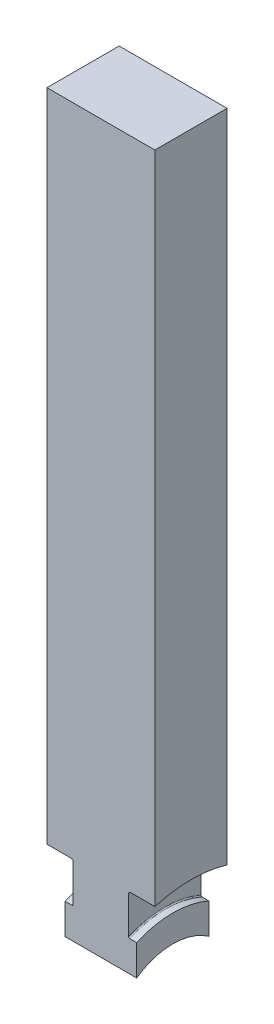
ISO-10303-21;
HEADER;
FILE_DESCRIPTION(('STEP AP214'),'2;1');
FILE_NAME('part.step','',(''),(''),'','','');
FILE_SCHEMA(('AUTOMOTIVE_DESIGN { 1 0 10303 214 1 1 1 1 }'));
ENDSEC;
DATA;
#1=APPLICATION_CONTEXT('core data for automotive mechanical design processes');
#2=APPLICATION_PROTOCOL_DEFINITION('international standard','automotive_design',2000,#1);
#3=PRODUCT_CONTEXT('',#1,'mechanical');
#4=PRODUCT('Part','Part','',(#3));
#5=PRODUCT_RELATED_PRODUCT_CATEGORY('part','',(#4));
#6=PRODUCT_DEFINITION_FORMATION('','',#4);
#7=PRODUCT_DEFINITION_CONTEXT('part definition',#1,'design');
#8=PRODUCT_DEFINITION('design','',#6,#7);
#9=PRODUCT_DEFINITION_SHAPE('','',#8);
#10=(LENGTH_UNIT() NAMED_UNIT(*) SI_UNIT(.MILLI.,.METRE.));
#11=(NAMED_UNIT(*) PLANE_ANGLE_UNIT() SI_UNIT($,.RADIAN.));
#12=(NAMED_UNIT(*) SI_UNIT($,.STERADIAN.) SOLID_ANGLE_UNIT());
#13=UNCERTAINTY_MEASURE_WITH_UNIT(LENGTH_MEASURE(1.E-05),#10,'distance_accuracy_value','');
#14=(GEOMETRIC_REPRESENTATION_CONTEXT(3) GLOBAL_UNCERTAINTY_ASSIGNED_CONTEXT((#13)) GLOBAL_UNIT_ASSIGNED_CONTEXT((#10,
#11,#12)) REPRESENTATION_CONTEXT('',''));
#15=CARTESIAN_POINT('',(0.,0.,0.));
#16=DIRECTION('',(0.,0.,1.));
#17=DIRECTION('',(1.,0.,0.));
#18=AXIS2_PLACEMENT_3D('',#15,#16,#17);
#19=CARTESIAN_POINT('',(19.177,276.225,12.827));
#20=DIRECTION('',(0.,0.,-1.));
#21=DIRECTION('',(0.,1.,0.));
#22=AXIS2_PLACEMENT_3D('',#19,#20,#21);
#23=PLANE('',#22);
#24=DIRECTION('',(-1.,0.,0.));
#25=VECTOR('',#24,1.);
#26=CARTESIAN_POINT('',(-8.84822894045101,29.043597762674,12.827));
#27=LINE('',#26,#25);
#28=CARTESIAN_POINT('',(-12.7,29.043597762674,12.827));
#29=VERTEX_POINT('',#28);
#30=CARTESIAN_POINT('',(-10.2362,29.043597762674,12.827));
#31=VERTEX_POINT('',#30);
#32=EDGE_CURVE('E196',#29,#31,#27,.F.);
#33=ORIENTED_EDGE('',*,*,#32,.F.);
#34=DIRECTION('',(0.,1.,0.));
#35=VECTOR('',#34,1.);
#36=CARTESIAN_POINT('',(-12.7,31.75,12.827));
#37=LINE('',#36,#35);
#38=CARTESIAN_POINT('',(-12.7,18.149895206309,12.827));
#39=VERTEX_POINT('',#38);
#40=EDGE_CURVE('E178',#39,#29,#37,.T.);
#41=ORIENTED_EDGE('',*,*,#40,.F.);
#42=DIRECTION('',(1.,0.,0.));
#43=VECTOR('',#42,1.);
#44=CARTESIAN_POINT('',(-19.177,18.1498952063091,12.827));
#45=LINE('',#44,#43);
#46=CARTESIAN_POINT('',(12.7,18.149895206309,12.827));
#47=VERTEX_POINT('',#46);
#48=EDGE_CURVE('E176',#39,#47,#45,.T.);
#49=ORIENTED_EDGE('',*,*,#48,.T.);
#50=DIRECTION('',(0.,-1.,0.));
#51=VECTOR('',#50,1.);
#52=CARTESIAN_POINT('',(12.7,31.75,12.827));
#53=LINE('',#52,#51);
#54=CARTESIAN_POINT('',(12.7,29.043597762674,12.827));
#55=VERTEX_POINT('',#54);
#56=EDGE_CURVE('E165',#55,#47,#53,.T.);
#57=ORIENTED_EDGE('',*,*,#56,.F.);
#58=DIRECTION('',(-1.,0.,0.));
#59=VECTOR('',#58,1.);
#60=CARTESIAN_POINT('',(-8.84822894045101,29.043597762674,12.827));
#61=LINE('',#60,#59);
#62=CARTESIAN_POINT('',(10.2362,29.043597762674,12.827));
#63=VERTEX_POINT('',#62);
#64=EDGE_CURVE('E152',#63,#55,#61,.F.);
#65=ORIENTED_EDGE('',*,*,#64,.F.);
#66=CARTESIAN_POINT('',(10.2362,29.043597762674,12.827));
#67=CARTESIAN_POINT('',(10.2160708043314,29.0435722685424,12.827));
#68=CARTESIAN_POINT('',(10.1959577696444,29.0453398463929,12.827));
#69=CARTESIAN_POINT('',(10.1563845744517,29.0522597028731,12.827));
#70=CARTESIAN_POINT('',(10.1369225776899,29.057401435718,12.827));
#71=CARTESIAN_POINT('',(10.0991468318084,29.0708679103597,12.827));
#72=CARTESIAN_POINT('',(10.0808326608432,29.0791914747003,12.827));
#73=CARTESIAN_POINT('',(10.0457902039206,29.0986936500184,12.827));
#74=CARTESIAN_POINT('',(10.0290627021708,29.1098736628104,12.827));
#75=CARTESIAN_POINT('',(9.99700861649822,29.1351379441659,12.827));
#76=CARTESIAN_POINT('',(9.98175149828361,29.1493101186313,12.827));
#77=CARTESIAN_POINT('',(9.95361671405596,29.1798419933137,12.827));
#78=CARTESIAN_POINT('',(9.9407396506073,29.1962022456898,12.827));
#79=CARTESIAN_POINT('',(9.91662869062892,29.2320467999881,12.827));
#80=CARTESIAN_POINT('',(9.90561137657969,29.2516766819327,12.827));
#81=CARTESIAN_POINT('',(9.8867485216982,29.2924113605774,12.827));
#82=CARTESIAN_POINT('',(9.87890468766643,29.3135169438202,12.827));
#83=CARTESIAN_POINT('',(9.86687995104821,29.3553145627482,12.827));
#84=CARTESIAN_POINT('',(9.86250087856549,29.375950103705,12.827));
#85=CARTESIAN_POINT('',(9.85666099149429,29.417597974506,12.827));
#86=CARTESIAN_POINT('',(9.85519567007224,29.4386096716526,12.827));
#87=CARTESIAN_POINT('',(9.8552,29.4596203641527,12.827));
#88=B_SPLINE_CURVE_WITH_KNOTS('',3,(#66,#67,#68,#69,#70,#71,#72,#73,#74,#75,#76,#77,#78,#79,#80,
#81,#82,#83,#84,#85,#86,#87),.UNSPECIFIED.,.F.,.F.,(4,2,2,2,2,2,2,2,2,2,4),(0.,
0.0602849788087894,0.120382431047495,0.180457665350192,0.240562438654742,0.302769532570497,
0.36499235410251,0.432238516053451,0.499520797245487,0.56260102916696,0.625583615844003),.UNSPECIFIED.);
#89=CARTESIAN_POINT('',(9.8552,29.4596203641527,12.827));
#90=VERTEX_POINT('',#89);
#91=EDGE_CURVE('E11',#63,#90,#88,.T.);
#92=ORIENTED_EDGE('',*,*,#91,.T.);
#93=DIRECTION('',(0.,-1.,0.));
#94=VECTOR('',#93,1.);
#95=CARTESIAN_POINT('',(9.8552,276.225,12.827));
#96=LINE('',#95,#94);
#97=CARTESIAN_POINT('',(9.8552,42.5855524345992,12.827));
#98=VERTEX_POINT('',#97);
#99=EDGE_CURVE('E211',#98,#90,#96,.T.);
#100=ORIENTED_EDGE('',*,*,#99,.F.);
#101=CARTESIAN_POINT('',(9.8552,42.5855524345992,12.827));
#102=CARTESIAN_POINT('',(9.85517024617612,42.6317662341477,12.827));
#103=CARTESIAN_POINT('',(9.85905310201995,42.6779817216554,12.827));
#104=CARTESIAN_POINT('',(9.87444611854,42.7691513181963,12.827));
#105=CARTESIAN_POINT('',(9.88596063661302,42.8141046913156,12.827));
#106=CARTESIAN_POINT('',(9.91643311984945,42.9014710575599,12.827));
#107=CARTESIAN_POINT('',(9.93539815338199,42.9438815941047,12.827));
#108=CARTESIAN_POINT('',(9.98032447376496,43.0247993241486,12.827));
#109=CARTESIAN_POINT('',(10.0062818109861,43.0633087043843,12.827));
#110=CARTESIAN_POINT('',(10.0639112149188,43.1343937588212,12.827));
#111=CARTESIAN_POINT('',(10.0954452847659,43.1670811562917,12.827));
#112=CARTESIAN_POINT('',(10.1637735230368,43.226428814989,12.827));
#113=CARTESIAN_POINT('',(10.200568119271,43.2530885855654,12.827));
#114=CARTESIAN_POINT('',(10.2767372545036,43.2984392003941,12.827));
#115=CARTESIAN_POINT('',(10.3159443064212,43.3174118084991,12.827));
#116=CARTESIAN_POINT('',(10.3970519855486,43.348201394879,12.827));
#117=CARTESIAN_POINT('',(10.438949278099,43.3600270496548,12.827));
#118=CARTESIAN_POINT('',(10.5038932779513,43.3722863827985,12.827));
#119=CARTESIAN_POINT('',(10.526453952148,43.3754629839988,12.827));
#120=CARTESIAN_POINT('',(10.571739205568,43.3796991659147,12.827));
#121=CARTESIAN_POINT('',(10.594463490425,43.3807618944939,12.827));
#122=CARTESIAN_POINT('',(10.6171999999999,43.3807610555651,12.827));
#123=B_SPLINE_CURVE_WITH_KNOTS('',3,(#101,#102,#103,#104,#105,#106,#107,#108,#109,#110,#111,
#112,#113,#114,#115,#116,#117,#118,#119,#120,#121,#122),.UNSPECIFIED.,.F.,.F.,(4,2,2,2,2,2,2,2,
2,2,4),(0.,0.138483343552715,0.277045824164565,0.415740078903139,0.554356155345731,
0.689928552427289,0.825511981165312,0.955539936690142,1.08540971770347,1.15367212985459,
1.22183281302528),.UNSPECIFIED.);
#124=CARTESIAN_POINT('',(10.6172,43.3807610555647,12.827));
#125=VERTEX_POINT('',#124);
#126=EDGE_CURVE('E295',#98,#125,#123,.T.);
#127=ORIENTED_EDGE('',*,*,#126,.T.);
#128=DIRECTION('',(-1.,0.,0.));
#129=VECTOR('',#128,1.);
#130=CARTESIAN_POINT('',(-8.84822894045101,43.3807610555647,12.827));
#131=LINE('',#130,#129);
#132=CARTESIAN_POINT('',(19.177,43.3807610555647,12.827));
#133=VERTEX_POINT('',#132);
#134=EDGE_CURVE('E206',#133,#125,#131,.T.);
#135=ORIENTED_EDGE('',*,*,#134,.F.);
#136=DIRECTION('',(0.,-1.,0.));
#137=VECTOR('',#136,1.);
#138=CARTESIAN_POINT('',(19.177,276.225,12.827));
#139=LINE('',#138,#137);
#140=CARTESIAN_POINT('',(19.177,276.225,12.827));
#141=VERTEX_POINT('',#140);
#142=EDGE_CURVE('E222',#141,#133,#139,.T.);
#143=ORIENTED_EDGE('',*,*,#142,.F.);
#144=DIRECTION('',(-1.,0.,0.));
#145=VECTOR('',#144,1.);
#146=CARTESIAN_POINT('',(19.177,276.225,12.827));
#147=LINE('',#146,#145);
#148=CARTESIAN_POINT('',(-19.177,276.225,12.827));
#149=VERTEX_POINT('',#148);
#150=EDGE_CURVE('E237',#141,#149,#147,.T.);
#151=ORIENTED_EDGE('',*,*,#150,.T.);
#152=DIRECTION('',(0.,-1.,0.));
#153=VECTOR('',#152,1.);
#154=CARTESIAN_POINT('',(-19.177,276.225,12.827));
#155=LINE('',#154,#153);
#156=CARTESIAN_POINT('',(-19.177,43.3807610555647,12.827));
#157=VERTEX_POINT('',#156);
#158=EDGE_CURVE('E231',#149,#157,#155,.T.);
#159=ORIENTED_EDGE('',*,*,#158,.T.);
#160=DIRECTION('',(-1.,0.,0.));
#161=VECTOR('',#160,1.);
#162=CARTESIAN_POINT('',(-8.84822894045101,43.3807610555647,12.827));
#163=LINE('',#162,#161);
#164=CARTESIAN_POINT('',(-10.6172,43.3807610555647,12.827));
#165=VERTEX_POINT('',#164);
#166=EDGE_CURVE('E202',#165,#157,#163,.T.);
#167=ORIENTED_EDGE('',*,*,#166,.F.);
#168=CARTESIAN_POINT('',(-10.6172,43.3807610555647,12.827));
#169=CARTESIAN_POINT('',(-10.5756065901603,43.3808045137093,12.827));
#170=CARTESIAN_POINT('',(-10.5340342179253,43.3772126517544,12.827));
#171=CARTESIAN_POINT('',(-10.4521637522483,43.363091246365,12.827));
#172=CARTESIAN_POINT('',(-10.411863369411,43.3525750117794,12.827));
#173=CARTESIAN_POINT('',(-10.3335975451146,43.3249343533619,12.827));
#174=CARTESIAN_POINT('',(-10.295632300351,43.3078093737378,12.827));
#175=CARTESIAN_POINT('',(-10.223045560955,43.2675367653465,12.827));
#176=CARTESIAN_POINT('',(-10.1884245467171,43.2443882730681,12.827));
#177=CARTESIAN_POINT('',(-10.1228284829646,43.1923475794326,12.827));
#178=CARTESIAN_POINT('',(-10.0919268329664,43.1633629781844,12.827));
#179=CARTESIAN_POINT('',(-10.0352031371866,43.1007883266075,12.827));
#180=CARTESIAN_POINT('',(-10.0093823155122,43.0671971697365,12.827));
#181=CARTESIAN_POINT('',(-9.96248271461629,42.9949745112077,12.827));
#182=CARTESIAN_POINT('',(-9.9416282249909,42.9561975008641,12.827));
#183=CARTESIAN_POINT('',(-9.90645002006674,42.8757858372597,12.827));
#184=CARTESIAN_POINT('',(-9.89212634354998,42.8341511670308,12.827));
#185=CARTESIAN_POINT('',(-9.87256356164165,42.7580053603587,12.827));
#186=CARTESIAN_POINT('',(-9.86605461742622,42.7238136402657,12.827));
#187=CARTESIAN_POINT('',(-9.85737265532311,42.6549344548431,12.827));
#188=CARTESIAN_POINT('',(-9.85519333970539,42.6202477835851,12.827));
#189=CARTESIAN_POINT('',(-9.85520000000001,42.5855524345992,12.827));
#190=B_SPLINE_CURVE_WITH_KNOTS('',3,(#168,#169,#170,#171,#172,#173,#174,#175,#176,#177,#178,
#179,#180,#181,#182,#183,#184,#185,#186,#187,#188,#189),.UNSPECIFIED.,.F.,.F.,(4,2,2,2,2,2,2,2,
2,2,4),(0.,0.124593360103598,0.248947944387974,0.373312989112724,0.497695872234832,
0.624229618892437,0.750793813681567,0.882295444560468,1.01379785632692,1.11794997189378,
1.22195048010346),.UNSPECIFIED.);
#191=CARTESIAN_POINT('',(-9.85520000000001,42.5855524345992,12.827));
#192=VERTEX_POINT('',#191);
#193=EDGE_CURVE('E264',#165,#192,#190,.T.);
#194=ORIENTED_EDGE('',*,*,#193,.T.);
#195=DIRECTION('',(0.,1.,0.));
#196=VECTOR('',#195,1.);
#197=CARTESIAN_POINT('',(-9.85520000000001,276.225,12.827));
#198=LINE('',#197,#196);
#199=CARTESIAN_POINT('',(-9.85520000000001,29.4596203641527,12.827));
#200=VERTEX_POINT('',#199);
#201=EDGE_CURVE('E160',#200,#192,#198,.T.);
#202=ORIENTED_EDGE('',*,*,#201,.F.);
#203=CARTESIAN_POINT('',(-9.85520000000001,29.4596203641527,12.827));
#204=CARTESIAN_POINT('',(-9.85518989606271,29.4345722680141,12.827));
#205=CARTESIAN_POINT('',(-9.85727632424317,29.4095174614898,12.827));
#206=CARTESIAN_POINT('',(-9.86557747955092,29.3600490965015,12.827));
#207=CARTESIAN_POINT('',(-9.87180075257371,29.3356369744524,12.827));
#208=CARTESIAN_POINT('',(-9.8883214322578,29.2881862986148,12.827));
#209=CARTESIAN_POINT('',(-9.89862433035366,29.2651496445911,12.827));
#210=CARTESIAN_POINT('',(-9.92312499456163,29.2212642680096,12.827));
#211=CARTESIAN_POINT('',(-9.93731902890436,29.2004134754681,12.827));
#212=CARTESIAN_POINT('',(-9.96856972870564,29.1625759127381,12.827));
#213=CARTESIAN_POINT('',(-9.98546338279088,29.145454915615,12.827));
#214=CARTESIAN_POINT('',(-10.0221325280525,29.1146162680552,12.827));
#215=CARTESIAN_POINT('',(-10.0419075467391,29.1008980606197,12.827));
#216=CARTESIAN_POINT('',(-10.081919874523,29.0785475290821,12.827));
#217=CARTESIAN_POINT('',(-10.1019691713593,29.0695778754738,12.827));
#218=CARTESIAN_POINT('',(-10.1433538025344,29.0554628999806,12.827));
#219=CARTESIAN_POINT('',(-10.1646864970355,29.0503099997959,12.827));
#220=CARTESIAN_POINT('',(-10.1945530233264,29.0459922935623,12.827));
#221=CARTESIAN_POINT('',(-10.2028633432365,29.0450944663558,12.827));
#222=CARTESIAN_POINT('',(-10.2195142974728,29.0438978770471,12.827));
#223=CARTESIAN_POINT('',(-10.2278548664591,29.0435982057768,12.827));
#224=CARTESIAN_POINT('',(-10.2362,29.043597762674,12.827));
#225=B_SPLINE_CURVE_WITH_KNOTS('',3,(#203,#204,#205,#206,#207,#208,#209,#210,#211,#212,#213,
#214,#215,#216,#217,#218,#219,#220,#221,#222,#223,#224),.UNSPECIFIED.,.F.,.F.,(4,2,2,2,2,2,2,2,
2,2,4),(0.,0.0750698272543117,0.150295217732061,0.225622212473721,0.3008772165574,
0.372647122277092,0.444405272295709,0.509955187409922,0.575374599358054,0.60043367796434,
0.625454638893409),.UNSPECIFIED.);
#226=EDGE_CURVE('E309',#200,#31,#225,.T.);
#227=ORIENTED_EDGE('',*,*,#226,.T.);
#228=EDGE_LOOP('',(#33,#41,#49,#57,#65,#92,#100,#127,#135,#143,#151,#159,#167,#194,#202,#227));
#229=FACE_BOUND('',#228,.T.);
#230=ADVANCED_FACE('F37',(#229),#23,.F.);
#231=CARTESIAN_POINT('',(19.177,276.225,-12.827));
#232=DIRECTION('',(0.,0.,1.));
#233=DIRECTION('',(0.,-1.,0.));
#234=AXIS2_PLACEMENT_3D('',#231,#232,#233);
#235=PLANE('',#234);
#236=DIRECTION('',(1.,0.,0.));
#237=VECTOR('',#236,1.);
#238=CARTESIAN_POINT('',(-19.177,18.149895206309,-12.827));
#239=LINE('',#238,#237);
#240=CARTESIAN_POINT('',(12.7,18.149895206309,-12.827));
#241=VERTEX_POINT('',#240);
#242=CARTESIAN_POINT('',(-12.7,18.149895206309,-12.827));
#243=VERTEX_POINT('',#242);
#244=EDGE_CURVE('E214',#241,#243,#239,.F.);
#245=ORIENTED_EDGE('',*,*,#244,.T.);
#246=DIRECTION('',(0.,1.,0.));
#247=VECTOR('',#246,1.);
#248=CARTESIAN_POINT('',(-12.7,31.75,-12.827));
#249=LINE('',#248,#247);
#250=CARTESIAN_POINT('',(-12.7,29.043597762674,-12.827));
#251=VERTEX_POINT('',#250);
#252=EDGE_CURVE('E181',#243,#251,#249,.T.);
#253=ORIENTED_EDGE('',*,*,#252,.T.);
#254=DIRECTION('',(-1.,0.,0.));
#255=VECTOR('',#254,1.);
#256=CARTESIAN_POINT('',(-8.84822894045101,29.043597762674,-12.827));
#257=LINE('',#256,#255);
#258=CARTESIAN_POINT('',(-10.2362,29.043597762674,-12.827));
#259=VERTEX_POINT('',#258);
#260=EDGE_CURVE('E193',#259,#251,#257,.T.);
#261=ORIENTED_EDGE('',*,*,#260,.F.);
#262=CARTESIAN_POINT('',(-10.2362,29.043597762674,-12.827));
#263=CARTESIAN_POINT('',(-10.2160708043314,29.0435722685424,-12.827));
#264=CARTESIAN_POINT('',(-10.1959577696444,29.0453398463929,-12.827));
#265=CARTESIAN_POINT('',(-10.1563845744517,29.0522597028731,-12.827));
#266=CARTESIAN_POINT('',(-10.1369225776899,29.0574014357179,-12.827));
#267=CARTESIAN_POINT('',(-10.0991468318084,29.0708679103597,-12.827));
#268=CARTESIAN_POINT('',(-10.0808326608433,29.0791914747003,-12.827));
#269=CARTESIAN_POINT('',(-10.0457902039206,29.0986936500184,-12.827));
#270=CARTESIAN_POINT('',(-10.0290627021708,29.1098736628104,-12.827));
#271=CARTESIAN_POINT('',(-9.99700861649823,29.1351379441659,-12.827));
#272=CARTESIAN_POINT('',(-9.98175149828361,29.1493101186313,-12.827));
#273=CARTESIAN_POINT('',(-9.95361671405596,29.1798419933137,-12.827));
#274=CARTESIAN_POINT('',(-9.94073965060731,29.1962022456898,-12.827));
#275=CARTESIAN_POINT('',(-9.91662869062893,29.2320467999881,-12.827));
#276=CARTESIAN_POINT('',(-9.9056113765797,29.2516766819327,-12.827));
#277=CARTESIAN_POINT('',(-9.88674852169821,29.2924113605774,-12.827));
#278=CARTESIAN_POINT('',(-9.87890468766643,29.3135169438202,-12.827));
#279=CARTESIAN_POINT('',(-9.86687995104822,29.3553145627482,-12.827));
#280=CARTESIAN_POINT('',(-9.86250087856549,29.375950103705,-12.827));
#281=CARTESIAN_POINT('',(-9.85666099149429,29.4175979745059,-12.827));
#282=CARTESIAN_POINT('',(-9.85519567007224,29.4386096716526,-12.827));
#283=CARTESIAN_POINT('',(-9.85520000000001,29.4596203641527,-12.827));
#284=B_SPLINE_CURVE_WITH_KNOTS('',3,(#262,#263,#264,#265,#266,#267,#268,#269,#270,#271,#272,
#273,#274,#275,#276,#277,#278,#279,#280,#281,#282,#283),.UNSPECIFIED.,.F.,.F.,(4,2,2,2,2,2,2,2,
2,2,4),(0.,0.0602849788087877,0.120382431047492,0.180457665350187,0.240562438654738,
0.302769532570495,0.364992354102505,0.432238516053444,0.49952079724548,0.562601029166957,
0.625583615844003),.UNSPECIFIED.);
#285=CARTESIAN_POINT('',(-9.85520000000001,29.4596203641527,-12.827));
#286=VERTEX_POINT('',#285);
#287=EDGE_CURVE('E315',#259,#286,#284,.T.);
#288=ORIENTED_EDGE('',*,*,#287,.T.);
#289=DIRECTION('',(0.,-1.,0.));
#290=VECTOR('',#289,1.);
#291=CARTESIAN_POINT('',(-9.85520000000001,276.225,-12.827));
#292=LINE('',#291,#290);
#293=CARTESIAN_POINT('',(-9.85520000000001,42.5855524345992,-12.827));
#294=VERTEX_POINT('',#293);
#295=EDGE_CURVE('E240',#294,#286,#292,.T.);
#296=ORIENTED_EDGE('',*,*,#295,.F.);
#297=CARTESIAN_POINT('',(-9.85520000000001,42.5855524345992,-12.827));
#298=CARTESIAN_POINT('',(-9.85517024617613,42.6317662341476,-12.827));
#299=CARTESIAN_POINT('',(-9.85905310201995,42.6779817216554,-12.827));
#300=CARTESIAN_POINT('',(-9.87444611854,42.7691513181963,-12.827));
#301=CARTESIAN_POINT('',(-9.88596063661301,42.8141046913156,-12.827));
#302=CARTESIAN_POINT('',(-9.91643311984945,42.9014710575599,-12.827));
#303=CARTESIAN_POINT('',(-9.93539815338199,42.9438815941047,-12.827));
#304=CARTESIAN_POINT('',(-9.98032447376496,43.0247993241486,-12.827));
#305=CARTESIAN_POINT('',(-10.0062818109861,43.0633087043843,-12.827));
#306=CARTESIAN_POINT('',(-10.0639112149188,43.1343937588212,-12.827));
#307=CARTESIAN_POINT('',(-10.0954452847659,43.1670811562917,-12.827));
#308=CARTESIAN_POINT('',(-10.1637735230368,43.226428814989,-12.827));
#309=CARTESIAN_POINT('',(-10.200568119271,43.2530885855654,-12.827));
#310=CARTESIAN_POINT('',(-10.2767372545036,43.2984392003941,-12.827));
#311=CARTESIAN_POINT('',(-10.3159443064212,43.3174118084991,-12.827));
#312=CARTESIAN_POINT('',(-10.3970519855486,43.348201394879,-12.827));
#313=CARTESIAN_POINT('',(-10.438949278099,43.3600270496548,-12.827));
#314=CARTESIAN_POINT('',(-10.5038932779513,43.3722863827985,-12.827));
#315=CARTESIAN_POINT('',(-10.526453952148,43.3754629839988,-12.827));
#316=CARTESIAN_POINT('',(-10.571739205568,43.3796991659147,-12.827));
#317=CARTESIAN_POINT('',(-10.594463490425,43.3807618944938,-12.827));
#318=CARTESIAN_POINT('',(-10.6171999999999,43.3807610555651,-12.827));
#319=B_SPLINE_CURVE_WITH_KNOTS('',3,(#297,#298,#299,#300,#301,#302,#303,#304,#305,#306,#307,
#308,#309,#310,#311,#312,#313,#314,#315,#316,#317,#318),.UNSPECIFIED.,.F.,.F.,(4,2,2,2,2,2,2,2,
2,2,4),(0.,0.138483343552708,0.277045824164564,0.415740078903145,0.554356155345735,
0.689928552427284,0.825511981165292,0.955539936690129,1.08540971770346,1.15367212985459,
1.22183281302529),.UNSPECIFIED.);
#320=CARTESIAN_POINT('',(-10.6172,43.3807610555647,-12.827));
#321=VERTEX_POINT('',#320);
#322=EDGE_CURVE('E256',#294,#321,#319,.T.);
#323=ORIENTED_EDGE('',*,*,#322,.T.);
#324=DIRECTION('',(-1.,0.,0.));
#325=VECTOR('',#324,1.);
#326=CARTESIAN_POINT('',(-8.84822894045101,43.3807610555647,-12.827));
#327=LINE('',#326,#325);
#328=CARTESIAN_POINT('',(-19.177,43.3807610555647,-12.827));
#329=VERTEX_POINT('',#328);
#330=EDGE_CURVE('E199',#329,#321,#327,.F.);
#331=ORIENTED_EDGE('',*,*,#330,.F.);
#332=DIRECTION('',(0.,1.,0.));
#333=VECTOR('',#332,1.);
#334=CARTESIAN_POINT('',(-19.177,276.225,-12.827));
#335=LINE('',#334,#333);
#336=CARTESIAN_POINT('',(-19.177,276.225,-12.827));
#337=VERTEX_POINT('',#336);
#338=EDGE_CURVE('E223',#329,#337,#335,.T.);
#339=ORIENTED_EDGE('',*,*,#338,.T.);
#340=DIRECTION('',(-1.,0.,0.));
#341=VECTOR('',#340,1.);
#342=CARTESIAN_POINT('',(19.177,276.225,-12.827));
#343=LINE('',#342,#341);
#344=CARTESIAN_POINT('',(19.177,276.225,-12.827));
#345=VERTEX_POINT('',#344);
#346=EDGE_CURVE('E228',#345,#337,#343,.T.);
#347=ORIENTED_EDGE('',*,*,#346,.F.);
#348=DIRECTION('',(0.,1.,0.));
#349=VECTOR('',#348,1.);
#350=CARTESIAN_POINT('',(19.177,276.225,-12.827));
#351=LINE('',#350,#349);
#352=CARTESIAN_POINT('',(19.177,43.3807610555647,-12.827));
#353=VERTEX_POINT('',#352);
#354=EDGE_CURVE('E226',#353,#345,#351,.T.);
#355=ORIENTED_EDGE('',*,*,#354,.F.);
#356=DIRECTION('',(-1.,0.,0.));
#357=VECTOR('',#356,1.);
#358=CARTESIAN_POINT('',(-8.84822894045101,43.3807610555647,-12.827));
#359=LINE('',#358,#357);
#360=CARTESIAN_POINT('',(10.6172,43.3807610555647,-12.827));
#361=VERTEX_POINT('',#360);
#362=EDGE_CURVE('E204',#361,#353,#359,.F.);
#363=ORIENTED_EDGE('',*,*,#362,.F.);
#364=CARTESIAN_POINT('',(10.6172,43.3807610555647,-12.827));
#365=CARTESIAN_POINT('',(10.5756065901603,43.3808045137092,-12.827));
#366=CARTESIAN_POINT('',(10.5340342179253,43.3772126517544,-12.827));
#367=CARTESIAN_POINT('',(10.4521637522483,43.363091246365,-12.827));
#368=CARTESIAN_POINT('',(10.411863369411,43.3525750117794,-12.827));
#369=CARTESIAN_POINT('',(10.3335975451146,43.3249343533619,-12.827));
#370=CARTESIAN_POINT('',(10.295632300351,43.3078093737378,-12.827));
#371=CARTESIAN_POINT('',(10.223045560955,43.2675367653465,-12.827));
#372=CARTESIAN_POINT('',(10.1884245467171,43.2443882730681,-12.827));
#373=CARTESIAN_POINT('',(10.1228284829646,43.1923475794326,-12.827));
#374=CARTESIAN_POINT('',(10.0919268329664,43.1633629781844,-12.827));
#375=CARTESIAN_POINT('',(10.0352031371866,43.1007883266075,-12.827));
#376=CARTESIAN_POINT('',(10.0093823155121,43.0671971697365,-12.827));
#377=CARTESIAN_POINT('',(9.96248271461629,42.9949745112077,-12.827));
#378=CARTESIAN_POINT('',(9.9416282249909,42.9561975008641,-12.827));
#379=CARTESIAN_POINT('',(9.90645002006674,42.8757858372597,-12.827));
#380=CARTESIAN_POINT('',(9.89212634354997,42.8341511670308,-12.827));
#381=CARTESIAN_POINT('',(9.87256356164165,42.7580053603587,-12.827));
#382=CARTESIAN_POINT('',(9.86605461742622,42.7238136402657,-12.827));
#383=CARTESIAN_POINT('',(9.85737265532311,42.6549344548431,-12.827));
#384=CARTESIAN_POINT('',(9.85519333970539,42.6202477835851,-12.827));
#385=CARTESIAN_POINT('',(9.8552,42.5855524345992,-12.827));
#386=B_SPLINE_CURVE_WITH_KNOTS('',3,(#364,#365,#366,#367,#368,#369,#370,#371,#372,#373,#374,
#375,#376,#377,#378,#379,#380,#381,#382,#383,#384,#385),.UNSPECIFIED.,.F.,.F.,(4,2,2,2,2,2,2,2,
2,2,4),(0.,0.124593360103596,0.248947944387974,0.373312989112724,0.497695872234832,
0.624229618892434,0.750793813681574,0.882295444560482,1.01379785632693,1.11794997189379,
1.22195048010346),.UNSPECIFIED.);
#387=CARTESIAN_POINT('',(9.8552,42.5855524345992,-12.827));
#388=VERTEX_POINT('',#387);
#389=EDGE_CURVE('E289',#361,#388,#386,.T.);
#390=ORIENTED_EDGE('',*,*,#389,.T.);
#391=DIRECTION('',(0.,1.,0.));
#392=VECTOR('',#391,1.);
#393=CARTESIAN_POINT('',(9.8552,276.225,-12.827));
#394=LINE('',#393,#392);
#395=CARTESIAN_POINT('',(9.8552,29.4596203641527,-12.827));
#396=VERTEX_POINT('',#395);
#397=EDGE_CURVE('E170',#396,#388,#394,.T.);
#398=ORIENTED_EDGE('',*,*,#397,.F.);
#399=CARTESIAN_POINT('',(9.8552,29.4596203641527,-12.827));
#400=CARTESIAN_POINT('',(9.85518989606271,29.434572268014,-12.827));
#401=CARTESIAN_POINT('',(9.85727632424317,29.4095174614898,-12.827));
#402=CARTESIAN_POINT('',(9.86557747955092,29.3600490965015,-12.827));
#403=CARTESIAN_POINT('',(9.87180075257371,29.3356369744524,-12.827));
#404=CARTESIAN_POINT('',(9.8883214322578,29.2881862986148,-12.827));
#405=CARTESIAN_POINT('',(9.89862433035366,29.2651496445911,-12.827));
#406=CARTESIAN_POINT('',(9.92312499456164,29.2212642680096,-12.827));
#407=CARTESIAN_POINT('',(9.93731902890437,29.200413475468,-12.827));
#408=CARTESIAN_POINT('',(9.96856972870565,29.1625759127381,-12.827));
#409=CARTESIAN_POINT('',(9.98546338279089,29.145454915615,-12.827));
#410=CARTESIAN_POINT('',(10.0221325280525,29.1146162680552,-12.827));
#411=CARTESIAN_POINT('',(10.0419075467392,29.1008980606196,-12.827));
#412=CARTESIAN_POINT('',(10.081919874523,29.0785475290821,-12.827));
#413=CARTESIAN_POINT('',(10.1019691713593,29.0695778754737,-12.827));
#414=CARTESIAN_POINT('',(10.1433538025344,29.0554628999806,-12.827));
#415=CARTESIAN_POINT('',(10.1646864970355,29.0503099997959,-12.827));
#416=CARTESIAN_POINT('',(10.1945530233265,29.0459922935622,-12.827));
#417=CARTESIAN_POINT('',(10.2028633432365,29.0450944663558,-12.827));
#418=CARTESIAN_POINT('',(10.2195142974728,29.043897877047,-12.827));
#419=CARTESIAN_POINT('',(10.2278548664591,29.0435982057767,-12.827));
#420=CARTESIAN_POINT('',(10.2362,29.0435977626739,-12.827));
#421=B_SPLINE_CURVE_WITH_KNOTS('',3,(#399,#400,#401,#402,#403,#404,#405,#406,#407,#408,#409,
#410,#411,#412,#413,#414,#415,#416,#417,#418,#419,#420),.UNSPECIFIED.,.F.,.F.,(4,2,2,2,2,2,2,2,
2,2,4),(0.,0.0750698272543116,0.150295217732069,0.225622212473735,0.300877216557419,
0.372647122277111,0.444405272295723,0.509955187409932,0.575374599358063,0.600433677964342,
0.625454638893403),.UNSPECIFIED.);
#422=CARTESIAN_POINT('',(10.2362,29.043597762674,-12.827));
#423=VERTEX_POINT('',#422);
#424=EDGE_CURVE('E51',#396,#423,#421,.T.);
#425=ORIENTED_EDGE('',*,*,#424,.T.);
#426=DIRECTION('',(-1.,0.,0.));
#427=VECTOR('',#426,1.);
#428=CARTESIAN_POINT('',(-8.84822894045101,29.043597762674,-12.827));
#429=LINE('',#428,#427);
#430=CARTESIAN_POINT('',(12.7,29.043597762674,-12.827));
#431=VERTEX_POINT('',#430);
#432=EDGE_CURVE('E161',#431,#423,#429,.T.);
#433=ORIENTED_EDGE('',*,*,#432,.F.);
#434=DIRECTION('',(0.,-1.,0.));
#435=VECTOR('',#434,1.);
#436=CARTESIAN_POINT('',(12.7,31.75,-12.827));
#437=LINE('',#436,#435);
#438=EDGE_CURVE('E168',#431,#241,#437,.T.);
#439=ORIENTED_EDGE('',*,*,#438,.T.);
#440=EDGE_LOOP('',(#245,#253,#261,#288,#296,#323,#331,#339,#347,#355,#363,#390,#398,#425,#433,#439));
#441=FACE_BOUND('',#440,.T.);
#442=ADVANCED_FACE('F270',(#441),#235,.F.);
#443=CARTESIAN_POINT('',(-19.177,0.,0.));
#444=DIRECTION('',(-1.,0.,0.));
#445=DIRECTION('',(0.,0.,1.));
#446=AXIS2_PLACEMENT_3D('',#443,#444,#445);
#447=PLANE('',#446);
#448=ORIENTED_EDGE('',*,*,#338,.F.);
#449=CARTESIAN_POINT('',(-19.177,0.,0.));
#450=DIRECTION('',(-1.,0.,0.));
#451=DIRECTION('',(0.,0.,1.));
#452=AXIS2_PLACEMENT_3D('',#449,#450,#451);
#453=CIRCLE('',#452,45.2374);
#454=EDGE_CURVE('E189',#157,#329,#453,.T.);
#455=ORIENTED_EDGE('',*,*,#454,.F.);
#456=ORIENTED_EDGE('',*,*,#158,.F.);
#457=DIRECTION('',(0.,0.,1.));
#458=VECTOR('',#457,1.);
#459=CARTESIAN_POINT('',(-19.177,276.225,12.827));
#460=LINE('',#459,#458);
#461=EDGE_CURVE('E218',#337,#149,#460,.T.);
#462=ORIENTED_EDGE('',*,*,#461,.F.);
#463=EDGE_LOOP('',(#448,#455,#456,#462));
#464=FACE_BOUND('',#463,.T.);
#465=ADVANCED_FACE('F378',(#464),#447,.T.);
#466=CARTESIAN_POINT('',(19.177,276.225,12.827));
#467=DIRECTION('',(0.,-1.,0.));
#468=DIRECTION('',(0.,0.,-1.));
#469=AXIS2_PLACEMENT_3D('',#466,#467,#468);
#470=PLANE('',#469);
#471=ORIENTED_EDGE('',*,*,#461,.T.);
#472=ORIENTED_EDGE('',*,*,#150,.F.);
#473=DIRECTION('',(0.,0.,1.));
#474=VECTOR('',#473,1.);
#475=CARTESIAN_POINT('',(19.177,276.225,12.827));
#476=LINE('',#475,#474);
#477=EDGE_CURVE('E219',#345,#141,#476,.T.);
#478=ORIENTED_EDGE('',*,*,#477,.F.);
#479=ORIENTED_EDGE('',*,*,#346,.T.);
#480=EDGE_LOOP('',(#471,#472,#478,#479));
#481=FACE_BOUND('',#480,.T.);
#482=ADVANCED_FACE('F281',(#481),#470,.F.);
#483=CARTESIAN_POINT('',(19.177,0.,0.));
#484=DIRECTION('',(-1.,0.,0.));
#485=DIRECTION('',(0.,0.,1.));
#486=AXIS2_PLACEMENT_3D('',#483,#484,#485);
#487=PLANE('',#486);
#488=CARTESIAN_POINT('',(19.177,0.,0.));
#489=DIRECTION('',(-1.,0.,0.));
#490=DIRECTION('',(0.,0.,1.));
#491=AXIS2_PLACEMENT_3D('',#488,#489,#490);
#492=CIRCLE('',#491,45.2374);
#493=EDGE_CURVE('E190',#133,#353,#492,.T.);
#494=ORIENTED_EDGE('',*,*,#493,.T.);
#495=ORIENTED_EDGE('',*,*,#354,.T.);
#496=ORIENTED_EDGE('',*,*,#477,.T.);
#497=ORIENTED_EDGE('',*,*,#142,.T.);
#498=EDGE_LOOP('',(#494,#495,#496,#497));
#499=FACE_BOUND('',#498,.T.);
#500=ADVANCED_FACE('F366',(#499),#487,.F.);
#501=CARTESIAN_POINT('',(-19.177,0.,0.));
#502=DIRECTION('',(1.,0.,0.));
#503=DIRECTION('',(0.,0.,-1.));
#504=AXIS2_PLACEMENT_3D('',#501,#502,#503);
#505=CYLINDRICAL_SURFACE('',#504,22.225);
#506=ORIENTED_EDGE('',*,*,#48,.F.);
#507=CARTESIAN_POINT('',(-12.7,0.,0.));
#508=DIRECTION('',(1.,0.,0.));
#509=DIRECTION('',(0.,1.,0.));
#510=AXIS2_PLACEMENT_3D('',#507,#508,#509);
#511=CIRCLE('',#510,22.225);
#512=EDGE_CURVE('E186',#39,#243,#511,.F.);
#513=ORIENTED_EDGE('',*,*,#512,.T.);
#514=ORIENTED_EDGE('',*,*,#244,.F.);
#515=CARTESIAN_POINT('',(12.7,0.,0.));
#516=DIRECTION('',(-1.,0.,0.));
#517=DIRECTION('',(0.,-1.,0.));
#518=AXIS2_PLACEMENT_3D('',#515,#516,#517);
#519=CIRCLE('',#518,22.225);
#520=EDGE_CURVE('E184',#241,#47,#519,.F.);
#521=ORIENTED_EDGE('',*,*,#520,.T.);
#522=EDGE_LOOP('',(#506,#513,#514,#521));
#523=FACE_BOUND('',#522,.T.);
#524=ADVANCED_FACE('F385',(#523),#505,.F.);
#525=CARTESIAN_POINT('',(-9.85520000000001,31.75,0.));
#526=DIRECTION('',(-1.,0.,0.));
#527=DIRECTION('',(0.,0.,1.));
#528=AXIS2_PLACEMENT_3D('',#525,#526,#527);
#529=PLANE('',#528);
#530=ORIENTED_EDGE('',*,*,#295,.T.);
#531=CARTESIAN_POINT('',(-9.85520000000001,0.,0.));
#532=DIRECTION('',(-1.,0.,0.));
#533=DIRECTION('',(0.,0.,1.));
#534=AXIS2_PLACEMENT_3D('',#531,#532,#533);
#535=CIRCLE('',#534,32.131);
#536=EDGE_CURVE('E328',#286,#200,#535,.F.);
#537=ORIENTED_EDGE('',*,*,#536,.T.);
#538=ORIENTED_EDGE('',*,*,#201,.T.);
#539=CARTESIAN_POINT('',(-9.85520000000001,0.,0.));
#540=DIRECTION('',(-1.,0.,0.));
#541=DIRECTION('',(0.,0.,1.));
#542=AXIS2_PLACEMENT_3D('',#539,#540,#541);
#543=CIRCLE('',#542,44.4754);
#544=EDGE_CURVE('E246',#192,#294,#543,.T.);
#545=ORIENTED_EDGE('',*,*,#544,.T.);
#546=EDGE_LOOP('',(#530,#537,#538,#545));
#547=FACE_BOUND('',#546,.T.);
#548=ADVANCED_FACE('F383',(#547),#529,.T.);
#549=CARTESIAN_POINT('',(-8.84822894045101,0.,0.));
#550=DIRECTION('',(-1.,0.,0.));
#551=DIRECTION('',(0.,0.,1.));
#552=AXIS2_PLACEMENT_3D('',#549,#550,#551);
#553=CYLINDRICAL_SURFACE('',#552,45.2374);
#554=ORIENTED_EDGE('',*,*,#330,.T.);
#555=CARTESIAN_POINT('',(-10.6172,0.,0.));
#556=DIRECTION('',(-1.,0.,0.));
#557=DIRECTION('',(0.,0.,1.));
#558=AXIS2_PLACEMENT_3D('',#555,#556,#557);
#559=CIRCLE('',#558,45.2374);
#560=EDGE_CURVE('E249',#321,#165,#559,.F.);
#561=ORIENTED_EDGE('',*,*,#560,.T.);
#562=ORIENTED_EDGE('',*,*,#166,.T.);
#563=ORIENTED_EDGE('',*,*,#454,.T.);
#564=EDGE_LOOP('',(#554,#561,#562,#563));
#565=FACE_BOUND('',#564,.T.);
#566=ADVANCED_FACE('F380',(#565),#553,.F.);
#567=CARTESIAN_POINT('',(-8.84822894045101,0.,0.));
#568=DIRECTION('',(-1.,0.,0.));
#569=DIRECTION('',(0.,0.,1.));
#570=AXIS2_PLACEMENT_3D('',#567,#568,#569);
#571=CYLINDRICAL_SURFACE('',#570,31.75);
#572=ORIENTED_EDGE('',*,*,#32,.T.);
#573=CARTESIAN_POINT('',(-10.2362,0.,0.));
#574=DIRECTION('',(-1.,0.,0.));
#575=DIRECTION('',(0.,0.,1.));
#576=AXIS2_PLACEMENT_3D('',#573,#574,#575);
#577=CIRCLE('',#576,31.75);
#578=EDGE_CURVE('E301',#31,#259,#577,.T.);
#579=ORIENTED_EDGE('',*,*,#578,.T.);
#580=ORIENTED_EDGE('',*,*,#260,.T.);
#581=CARTESIAN_POINT('',(-12.7,0.,0.));
#582=DIRECTION('',(1.,0.,0.));
#583=DIRECTION('',(0.,1.,0.));
#584=AXIS2_PLACEMENT_3D('',#581,#582,#583);
#585=CIRCLE('',#584,31.75);
#586=EDGE_CURVE('E169',#29,#251,#585,.F.);
#587=ORIENTED_EDGE('',*,*,#586,.F.);
#588=EDGE_LOOP('',(#572,#579,#580,#587));
#589=FACE_BOUND('',#588,.T.);
#590=ADVANCED_FACE('F336',(#589),#571,.T.);
#591=CARTESIAN_POINT('',(9.8552,31.75,0.));
#592=DIRECTION('',(1.,0.,0.));
#593=DIRECTION('',(0.,0.,-1.));
#594=AXIS2_PLACEMENT_3D('',#591,#592,#593);
#595=PLANE('',#594);
#596=ORIENTED_EDGE('',*,*,#99,.T.);
#597=CARTESIAN_POINT('',(9.8552,0.,0.));
#598=DIRECTION('',(1.,0.,0.));
#599=DIRECTION('',(0.,0.,-1.));
#600=AXIS2_PLACEMENT_3D('',#597,#598,#599);
#601=CIRCLE('',#600,32.131);
#602=EDGE_CURVE('E326',#90,#396,#601,.F.);
#603=ORIENTED_EDGE('',*,*,#602,.T.);
#604=ORIENTED_EDGE('',*,*,#397,.T.);
#605=CARTESIAN_POINT('',(9.8552,0.,0.));
#606=DIRECTION('',(1.,0.,0.));
#607=DIRECTION('',(0.,0.,-1.));
#608=AXIS2_PLACEMENT_3D('',#605,#606,#607);
#609=CIRCLE('',#608,44.4754);
#610=EDGE_CURVE('E254',#388,#98,#609,.T.);
#611=ORIENTED_EDGE('',*,*,#610,.T.);
#612=EDGE_LOOP('',(#596,#603,#604,#611));
#613=FACE_BOUND('',#612,.T.);
#614=ADVANCED_FACE('F356',(#613),#595,.T.);
#615=CARTESIAN_POINT('',(-8.84822894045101,0.,0.));
#616=DIRECTION('',(-1.,0.,0.));
#617=DIRECTION('',(0.,0.,1.));
#618=AXIS2_PLACEMENT_3D('',#615,#616,#617);
#619=CYLINDRICAL_SURFACE('',#618,31.75);
#620=ORIENTED_EDGE('',*,*,#432,.T.);
#621=CARTESIAN_POINT('',(10.2362,0.,0.));
#622=DIRECTION('',(1.,0.,0.));
#623=DIRECTION('',(0.,0.,-1.));
#624=AXIS2_PLACEMENT_3D('',#621,#622,#623);
#625=CIRCLE('',#624,31.75);
#626=EDGE_CURVE('E58',#423,#63,#625,.T.);
#627=ORIENTED_EDGE('',*,*,#626,.T.);
#628=ORIENTED_EDGE('',*,*,#64,.T.);
#629=CARTESIAN_POINT('',(12.7,0.,0.));
#630=DIRECTION('',(-1.,0.,0.));
#631=DIRECTION('',(0.,-1.,0.));
#632=AXIS2_PLACEMENT_3D('',#629,#630,#631);
#633=CIRCLE('',#632,31.75);
#634=EDGE_CURVE('E155',#431,#55,#633,.F.);
#635=ORIENTED_EDGE('',*,*,#634,.F.);
#636=EDGE_LOOP('',(#620,#627,#628,#635));
#637=FACE_BOUND('',#636,.T.);
#638=ADVANCED_FACE('F154',(#637),#619,.T.);
#639=CARTESIAN_POINT('',(-8.84822894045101,0.,0.));
#640=DIRECTION('',(-1.,0.,0.));
#641=DIRECTION('',(0.,0.,1.));
#642=AXIS2_PLACEMENT_3D('',#639,#640,#641);
#643=CYLINDRICAL_SURFACE('',#642,45.2374);
#644=ORIENTED_EDGE('',*,*,#134,.T.);
#645=CARTESIAN_POINT('',(10.6172,0.,0.));
#646=DIRECTION('',(1.,0.,0.));
#647=DIRECTION('',(0.,0.,-1.));
#648=AXIS2_PLACEMENT_3D('',#645,#646,#647);
#649=CIRCLE('',#648,45.2374);
#650=EDGE_CURVE('E251',#125,#361,#649,.F.);
#651=ORIENTED_EDGE('',*,*,#650,.T.);
#652=ORIENTED_EDGE('',*,*,#362,.T.);
#653=ORIENTED_EDGE('',*,*,#493,.F.);
#654=EDGE_LOOP('',(#644,#651,#652,#653));
#655=FACE_BOUND('',#654,.T.);
#656=ADVANCED_FACE('F362',(#655),#643,.F.);
#657=CARTESIAN_POINT('',(12.7,31.75,-12.827));
#658=DIRECTION('',(-1.,0.,0.));
#659=DIRECTION('',(0.,-1.,0.));
#660=AXIS2_PLACEMENT_3D('',#657,#658,#659);
#661=PLANE('',#660);
#662=ORIENTED_EDGE('',*,*,#438,.F.);
#663=ORIENTED_EDGE('',*,*,#634,.T.);
#664=ORIENTED_EDGE('',*,*,#56,.T.);
#665=ORIENTED_EDGE('',*,*,#520,.F.);
#666=EDGE_LOOP('',(#662,#663,#664,#665));
#667=FACE_BOUND('',#666,.T.);
#668=ADVANCED_FACE('F164',(#667),#661,.F.);
#669=CARTESIAN_POINT('',(-12.7,31.75,-12.827));
#670=DIRECTION('',(1.,0.,0.));
#671=DIRECTION('',(0.,1.,0.));
#672=AXIS2_PLACEMENT_3D('',#669,#670,#671);
#673=PLANE('',#672);
#674=ORIENTED_EDGE('',*,*,#40,.T.);
#675=ORIENTED_EDGE('',*,*,#586,.T.);
#676=ORIENTED_EDGE('',*,*,#252,.F.);
#677=ORIENTED_EDGE('',*,*,#512,.F.);
#678=EDGE_LOOP('',(#674,#675,#676,#677));
#679=FACE_BOUND('',#678,.T.);
#680=ADVANCED_FACE('F279',(#679),#673,.F.);
#681=CARTESIAN_POINT('',(-10.6172,0.,0.));
#682=DIRECTION('',(-1.,0.,0.));
#683=DIRECTION('',(0.,0.,1.));
#684=AXIS2_PLACEMENT_3D('',#681,#682,#683);
#685=TOROIDAL_SURFACE('',#684,44.4754,0.762);
#686=ORIENTED_EDGE('',*,*,#193,.F.);
#687=ORIENTED_EDGE('',*,*,#560,.F.);
#688=ORIENTED_EDGE('',*,*,#322,.F.);
#689=ORIENTED_EDGE('',*,*,#544,.F.);
#690=EDGE_LOOP('',(#686,#687,#688,#689));
#691=FACE_BOUND('',#690,.T.);
#692=ADVANCED_FACE('F273',(#691),#685,.F.);
#693=CARTESIAN_POINT('',(10.6172,0.,0.));
#694=DIRECTION('',(1.,0.,0.));
#695=DIRECTION('',(0.,0.,-1.));
#696=AXIS2_PLACEMENT_3D('',#693,#694,#695);
#697=TOROIDAL_SURFACE('',#696,44.4754,0.762);
#698=ORIENTED_EDGE('',*,*,#126,.F.);
#699=ORIENTED_EDGE('',*,*,#610,.F.);
#700=ORIENTED_EDGE('',*,*,#389,.F.);
#701=ORIENTED_EDGE('',*,*,#650,.F.);
#702=EDGE_LOOP('',(#698,#699,#700,#701));
#703=FACE_BOUND('',#702,.T.);
#704=ADVANCED_FACE('F278',(#703),#697,.F.);
#705=CARTESIAN_POINT('',(-10.2362,0.,0.));
#706=DIRECTION('',(-1.,0.,0.));
#707=DIRECTION('',(0.,0.,1.));
#708=AXIS2_PLACEMENT_3D('',#705,#706,#707);
#709=TOROIDAL_SURFACE('',#708,32.131,0.381);
#710=ORIENTED_EDGE('',*,*,#226,.F.);
#711=ORIENTED_EDGE('',*,*,#536,.F.);
#712=ORIENTED_EDGE('',*,*,#287,.F.);
#713=ORIENTED_EDGE('',*,*,#578,.F.);
#714=EDGE_LOOP('',(#710,#711,#712,#713));
#715=FACE_BOUND('',#714,.T.);
#716=ADVANCED_FACE('F285',(#715),#709,.F.);
#717=CARTESIAN_POINT('',(10.2362,0.,0.));
#718=DIRECTION('',(1.,0.,0.));
#719=DIRECTION('',(0.,0.,-1.));
#720=AXIS2_PLACEMENT_3D('',#717,#718,#719);
#721=TOROIDAL_SURFACE('',#720,32.131,0.381);
#722=ORIENTED_EDGE('',*,*,#91,.F.);
#723=ORIENTED_EDGE('',*,*,#626,.F.);
#724=ORIENTED_EDGE('',*,*,#424,.F.);
#725=ORIENTED_EDGE('',*,*,#602,.F.);
#726=EDGE_LOOP('',(#722,#723,#724,#725));
#727=FACE_BOUND('',#726,.T.);
#728=ADVANCED_FACE('F39',(#727),#721,.F.);
#729=CLOSED_SHELL('',(#230,#442,#465,#482,#500,#524,#548,#566,#590,#614,#638,#656,#668,#680,
#692,#704,#716,#728));
#730=MANIFOLD_SOLID_BREP('B2',#729);
#731=ADVANCED_BREP_SHAPE_REPRESENTATION('',(#18,#730),#14);
#732=SHAPE_DEFINITION_REPRESENTATION(#9,#731);
ENDSEC;
END-ISO-10303-21;
